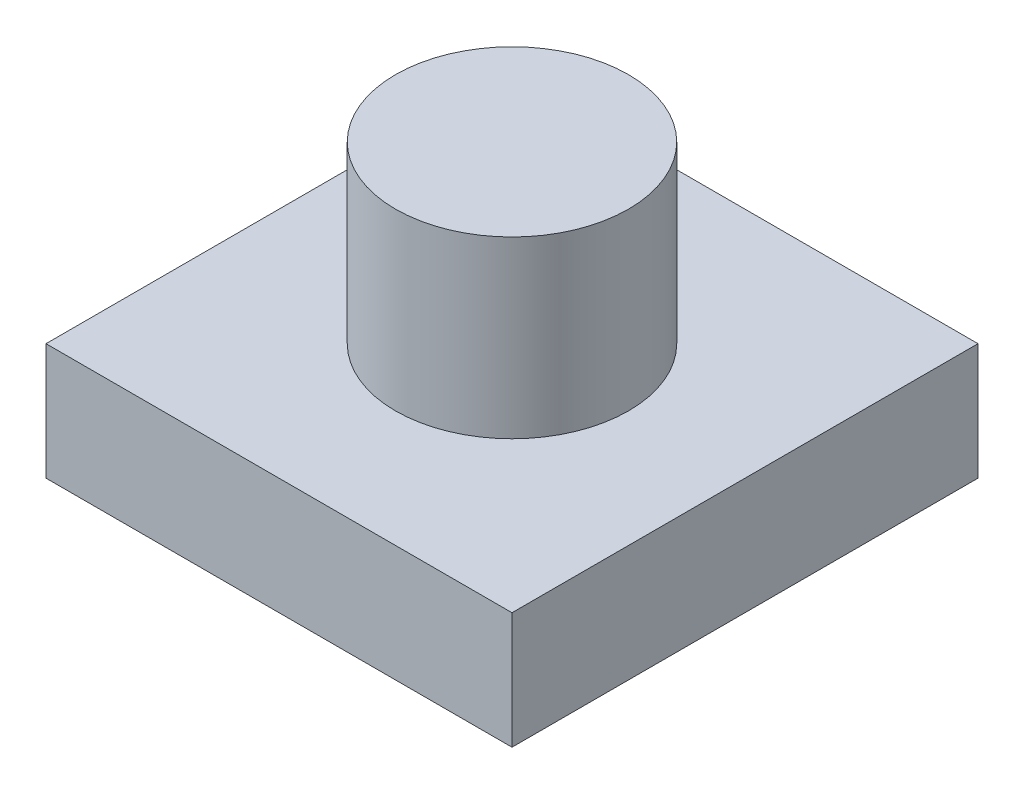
from build123d import *

# Parameters (mm, degrees)
SKETCH1_W           = 12.7
SKETCH1_H           = 12.7
BOSS_EXTRUDE1_DEPTH = 3.175
SKETCH2_R           = 3.175
BOSS_EXTRUDE2_DEPTH = 4.7625


with BuildPart() as part:
    # Sketch1 → Boss-Extrude1 (new body)
    with BuildSketch(Plane(origin=(0, 0, 0), x_dir=(1, 0, 0), z_dir=(0, 1, 0))):
        Rectangle(SKETCH1_W, SKETCH1_H)
    extrude(amount=BOSS_EXTRUDE1_DEPTH)

    # Sketch2 → Boss-Extrude2 (add)
    with BuildSketch(Plane(origin=(0, 3.175, 0), x_dir=(1, 0, 0), z_dir=(0, 1, 0))):
        with Locations(Location((0, 0, 0), (0, 0, 270))):
            Circle(SKETCH2_R)
    extrude(amount=BOSS_EXTRUDE2_DEPTH)


solid = part.part
